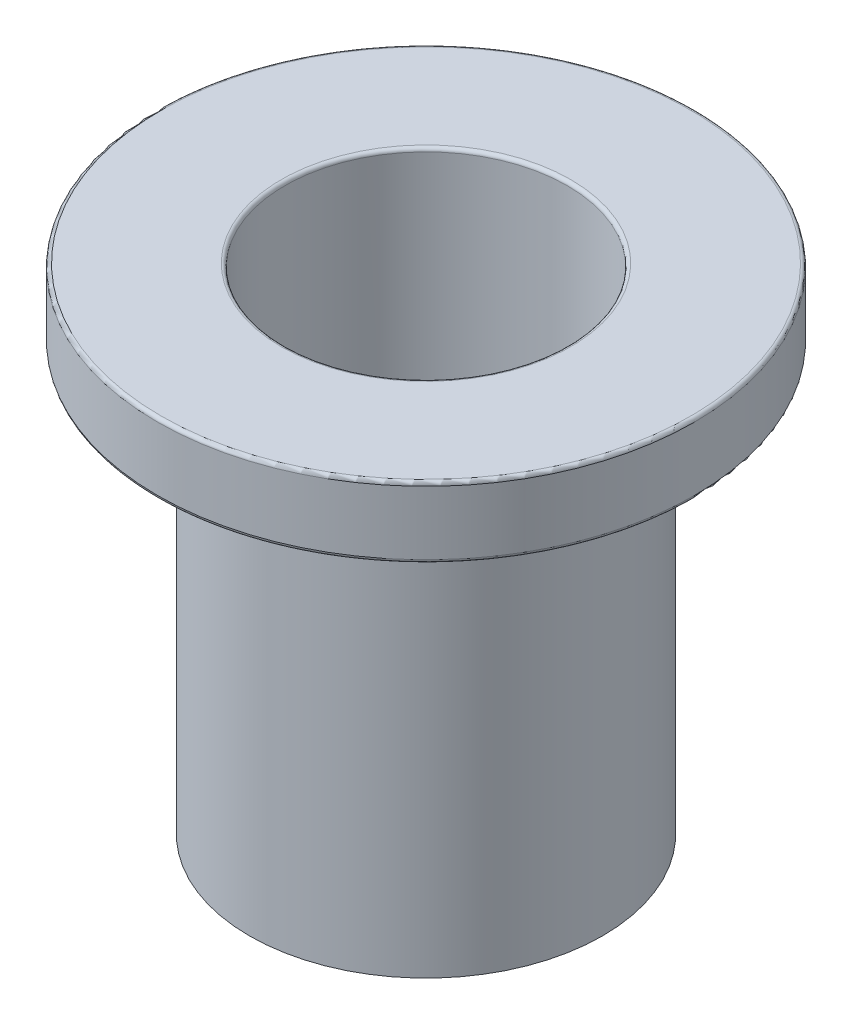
ISO-10303-21;
HEADER;
FILE_DESCRIPTION(('STEP AP214'),'2;1');
FILE_NAME('part.step','',(''),(''),'','','');
FILE_SCHEMA(('AUTOMOTIVE_DESIGN { 1 0 10303 214 1 1 1 1 }'));
ENDSEC;
DATA;
#1=APPLICATION_CONTEXT('core data for automotive mechanical design processes');
#2=APPLICATION_PROTOCOL_DEFINITION('international standard','automotive_design',2000,#1);
#3=PRODUCT_CONTEXT('',#1,'mechanical');
#4=PRODUCT('Part','Part','',(#3));
#5=PRODUCT_RELATED_PRODUCT_CATEGORY('part','',(#4));
#6=PRODUCT_DEFINITION_FORMATION('','',#4);
#7=PRODUCT_DEFINITION_CONTEXT('part definition',#1,'design');
#8=PRODUCT_DEFINITION('design','',#6,#7);
#9=PRODUCT_DEFINITION_SHAPE('','',#8);
#10=(LENGTH_UNIT() NAMED_UNIT(*) SI_UNIT(.MILLI.,.METRE.));
#11=(NAMED_UNIT(*) PLANE_ANGLE_UNIT() SI_UNIT($,.RADIAN.));
#12=(NAMED_UNIT(*) SI_UNIT($,.STERADIAN.) SOLID_ANGLE_UNIT());
#13=UNCERTAINTY_MEASURE_WITH_UNIT(LENGTH_MEASURE(1.E-05),#10,'distance_accuracy_value','');
#14=(GEOMETRIC_REPRESENTATION_CONTEXT(3) GLOBAL_UNCERTAINTY_ASSIGNED_CONTEXT((#13)) GLOBAL_UNIT_ASSIGNED_CONTEXT((#10,
#11,#12)) REPRESENTATION_CONTEXT('',''));
#15=CARTESIAN_POINT('',(0.,0.,0.));
#16=DIRECTION('',(0.,0.,1.));
#17=DIRECTION('',(1.,0.,0.));
#18=AXIS2_PLACEMENT_3D('',#15,#16,#17);
#19=CARTESIAN_POINT('',(3.175,0.,0.));
#20=DIRECTION('',(0.,-1.,0.));
#21=DIRECTION('',(0.,0.,-1.));
#22=AXIS2_PLACEMENT_3D('',#19,#20,#21);
#23=PLANE('',#22);
#24=CARTESIAN_POINT('',(0.,0.,0.));
#25=DIRECTION('',(0.,-1.,0.));
#26=DIRECTION('',(0.,0.,-1.));
#27=AXIS2_PLACEMENT_3D('',#24,#25,#26);
#28=CIRCLE('',#27,3.175);
#29=CARTESIAN_POINT('',(0.,0.,-3.175));
#30=VERTEX_POINT('',#29);
#31=EDGE_CURVE('E49',#30,#30,#28,.T.);
#32=ORIENTED_EDGE('',*,*,#31,.T.);
#33=EDGE_LOOP('',(#32));
#34=FACE_BOUND('',#33,.T.);
#35=CARTESIAN_POINT('',(0.,0.,0.));
#36=DIRECTION('',(0.,-1.,0.));
#37=DIRECTION('',(0.,0.,-1.));
#38=AXIS2_PLACEMENT_3D('',#35,#36,#37);
#39=CIRCLE('',#38,2.54);
#40=CARTESIAN_POINT('',(0.,0.,-2.54));
#41=VERTEX_POINT('',#40);
#42=EDGE_CURVE('E55',#41,#41,#39,.T.);
#43=ORIENTED_EDGE('',*,*,#42,.F.);
#44=EDGE_LOOP('',(#43));
#45=FACE_BOUND('',#44,.T.);
#46=ADVANCED_FACE('F24',(#34,#45),#23,.T.);
#47=CARTESIAN_POINT('',(0.,0.,0.));
#48=DIRECTION('',(0.,-1.,0.));
#49=DIRECTION('',(0.,0.,-1.));
#50=AXIS2_PLACEMENT_3D('',#47,#48,#49);
#51=CYLINDRICAL_SURFACE('',#50,3.175);
#52=CARTESIAN_POINT('',(0.,7.62,0.));
#53=DIRECTION('',(0.,-1.,0.));
#54=DIRECTION('',(0.,0.,-1.));
#55=AXIS2_PLACEMENT_3D('',#52,#53,#54);
#56=CIRCLE('',#55,3.175);
#57=CARTESIAN_POINT('',(0.,7.62,-3.175));
#58=VERTEX_POINT('',#57);
#59=EDGE_CURVE('E52',#58,#58,#56,.T.);
#60=ORIENTED_EDGE('',*,*,#59,.T.);
#61=EDGE_LOOP('',(#60));
#62=FACE_BOUND('',#61,.T.);
#63=ORIENTED_EDGE('',*,*,#31,.F.);
#64=EDGE_LOOP('',(#63));
#65=FACE_BOUND('',#64,.T.);
#66=ADVANCED_FACE('F62',(#62,#65),#51,.T.);
#67=CARTESIAN_POINT('',(4.826,7.62,0.));
#68=DIRECTION('',(0.,-1.,0.));
#69=DIRECTION('',(0.,0.,-1.));
#70=AXIS2_PLACEMENT_3D('',#67,#68,#69);
#71=PLANE('',#70);
#72=CARTESIAN_POINT('',(0.,7.62,0.));
#73=DIRECTION('',(0.,-1.,0.));
#74=DIRECTION('',(0.,0.,-1.));
#75=AXIS2_PLACEMENT_3D('',#72,#73,#74);
#76=CIRCLE('',#75,4.7625);
#77=CARTESIAN_POINT('',(0.,7.62,-4.7625));
#78=VERTEX_POINT('',#77);
#79=EDGE_CURVE('E34',#78,#78,#76,.T.);
#80=ORIENTED_EDGE('',*,*,#79,.T.);
#81=EDGE_LOOP('',(#80));
#82=FACE_BOUND('',#81,.T.);
#83=ORIENTED_EDGE('',*,*,#59,.F.);
#84=EDGE_LOOP('',(#83));
#85=FACE_BOUND('',#84,.T.);
#86=ADVANCED_FACE('F67',(#82,#85),#71,.T.);
#87=CARTESIAN_POINT('',(0.,0.,0.));
#88=DIRECTION('',(0.,-1.,0.));
#89=DIRECTION('',(0.,0.,-1.));
#90=AXIS2_PLACEMENT_3D('',#87,#88,#89);
#91=CYLINDRICAL_SURFACE('',#90,4.826);
#92=CARTESIAN_POINT('',(0.,7.6835,0.));
#93=DIRECTION('',(0.,-1.,0.));
#94=DIRECTION('',(0.,0.,-1.));
#95=AXIS2_PLACEMENT_3D('',#92,#93,#94);
#96=CIRCLE('',#95,4.826);
#97=CARTESIAN_POINT('',(0.,7.6835,-4.826));
#98=VERTEX_POINT('',#97);
#99=EDGE_CURVE('E10',#98,#98,#96,.F.);
#100=ORIENTED_EDGE('',*,*,#99,.T.);
#101=EDGE_LOOP('',(#100));
#102=FACE_BOUND('',#101,.T.);
#103=CARTESIAN_POINT('',(0.,8.8265,0.));
#104=DIRECTION('',(0.,1.,0.));
#105=DIRECTION('',(0.,0.,1.));
#106=AXIS2_PLACEMENT_3D('',#103,#104,#105);
#107=CIRCLE('',#106,4.826);
#108=CARTESIAN_POINT('',(0.,8.8265,4.826));
#109=VERTEX_POINT('',#108);
#110=EDGE_CURVE('E30',#109,#109,#107,.F.);
#111=ORIENTED_EDGE('',*,*,#110,.T.);
#112=EDGE_LOOP('',(#111));
#113=FACE_BOUND('',#112,.T.);
#114=ADVANCED_FACE('F74',(#102,#113),#91,.T.);
#115=CARTESIAN_POINT('',(2.54,8.89,0.));
#116=DIRECTION('',(0.,1.,0.));
#117=DIRECTION('',(0.,0.,1.));
#118=AXIS2_PLACEMENT_3D('',#115,#116,#117);
#119=PLANE('',#118);
#120=CARTESIAN_POINT('',(0.,8.89,0.));
#121=DIRECTION('',(0.,1.,0.));
#122=DIRECTION('',(0.,0.,1.));
#123=AXIS2_PLACEMENT_3D('',#120,#121,#122);
#124=CIRCLE('',#123,2.6035);
#125=CARTESIAN_POINT('',(0.,8.89,2.6035));
#126=VERTEX_POINT('',#125);
#127=EDGE_CURVE('E43',#126,#126,#124,.F.);
#128=ORIENTED_EDGE('',*,*,#127,.T.);
#129=EDGE_LOOP('',(#128));
#130=FACE_BOUND('',#129,.T.);
#131=CARTESIAN_POINT('',(0.,8.89,0.));
#132=DIRECTION('',(0.,1.,0.));
#133=DIRECTION('',(0.,0.,1.));
#134=AXIS2_PLACEMENT_3D('',#131,#132,#133);
#135=CIRCLE('',#134,4.7625);
#136=CARTESIAN_POINT('',(0.,8.89,4.7625));
#137=VERTEX_POINT('',#136);
#138=EDGE_CURVE('E46',#137,#137,#135,.T.);
#139=ORIENTED_EDGE('',*,*,#138,.T.);
#140=EDGE_LOOP('',(#139));
#141=FACE_BOUND('',#140,.T.);
#142=ADVANCED_FACE('F80',(#130,#141),#119,.T.);
#143=CARTESIAN_POINT('',(0.,0.,0.));
#144=DIRECTION('',(0.,-1.,0.));
#145=DIRECTION('',(0.,0.,-1.));
#146=AXIS2_PLACEMENT_3D('',#143,#144,#145);
#147=CYLINDRICAL_SURFACE('',#146,2.54);
#148=CARTESIAN_POINT('',(0.,8.8265,0.));
#149=DIRECTION('',(0.,1.,0.));
#150=DIRECTION('',(0.,0.,1.));
#151=AXIS2_PLACEMENT_3D('',#148,#149,#150);
#152=CIRCLE('',#151,2.54);
#153=CARTESIAN_POINT('',(0.,8.8265,2.54));
#154=VERTEX_POINT('',#153);
#155=EDGE_CURVE('E38',#154,#154,#152,.T.);
#156=ORIENTED_EDGE('',*,*,#155,.T.);
#157=EDGE_LOOP('',(#156));
#158=FACE_BOUND('',#157,.T.);
#159=ORIENTED_EDGE('',*,*,#42,.T.);
#160=EDGE_LOOP('',(#159));
#161=FACE_BOUND('',#160,.T.);
#162=ADVANCED_FACE('F59',(#158,#161),#147,.F.);
#163=CARTESIAN_POINT('',(0.,8.8265,0.));
#164=DIRECTION('',(0.,1.,0.));
#165=DIRECTION('',(0.,0.,1.));
#166=AXIS2_PLACEMENT_3D('',#163,#164,#165);
#167=TOROIDAL_SURFACE('',#166,2.6035,0.0635);
#168=ORIENTED_EDGE('',*,*,#155,.F.);
#169=EDGE_LOOP('',(#168));
#170=FACE_BOUND('',#169,.T.);
#171=ORIENTED_EDGE('',*,*,#127,.F.);
#172=EDGE_LOOP('',(#171));
#173=FACE_BOUND('',#172,.T.);
#174=ADVANCED_FACE('F86',(#170,#173),#167,.T.);
#175=CARTESIAN_POINT('',(0.,7.6835,0.));
#176=DIRECTION('',(0.,-1.,0.));
#177=DIRECTION('',(0.,0.,-1.));
#178=AXIS2_PLACEMENT_3D('',#175,#176,#177);
#179=TOROIDAL_SURFACE('',#178,4.7625,0.0635);
#180=ORIENTED_EDGE('',*,*,#99,.F.);
#181=EDGE_LOOP('',(#180));
#182=FACE_BOUND('',#181,.T.);
#183=ORIENTED_EDGE('',*,*,#79,.F.);
#184=EDGE_LOOP('',(#183));
#185=FACE_BOUND('',#184,.T.);
#186=ADVANCED_FACE('F90',(#182,#185),#179,.T.);
#187=CARTESIAN_POINT('',(0.,8.8265,0.));
#188=DIRECTION('',(0.,1.,0.));
#189=DIRECTION('',(0.,0.,1.));
#190=AXIS2_PLACEMENT_3D('',#187,#188,#189);
#191=TOROIDAL_SURFACE('',#190,4.7625,0.0635);
#192=ORIENTED_EDGE('',*,*,#138,.F.);
#193=EDGE_LOOP('',(#192));
#194=FACE_BOUND('',#193,.T.);
#195=ORIENTED_EDGE('',*,*,#110,.F.);
#196=EDGE_LOOP('',(#195));
#197=FACE_BOUND('',#196,.T.);
#198=ADVANCED_FACE('F94',(#194,#197),#191,.T.);
#199=CLOSED_SHELL('',(#46,#66,#86,#114,#142,#162,#174,#186,#198));
#200=MANIFOLD_SOLID_BREP('B2',#199);
#201=ADVANCED_BREP_SHAPE_REPRESENTATION('',(#18,#200),#14);
#202=SHAPE_DEFINITION_REPRESENTATION(#9,#201);
ENDSEC;
END-ISO-10303-21;
